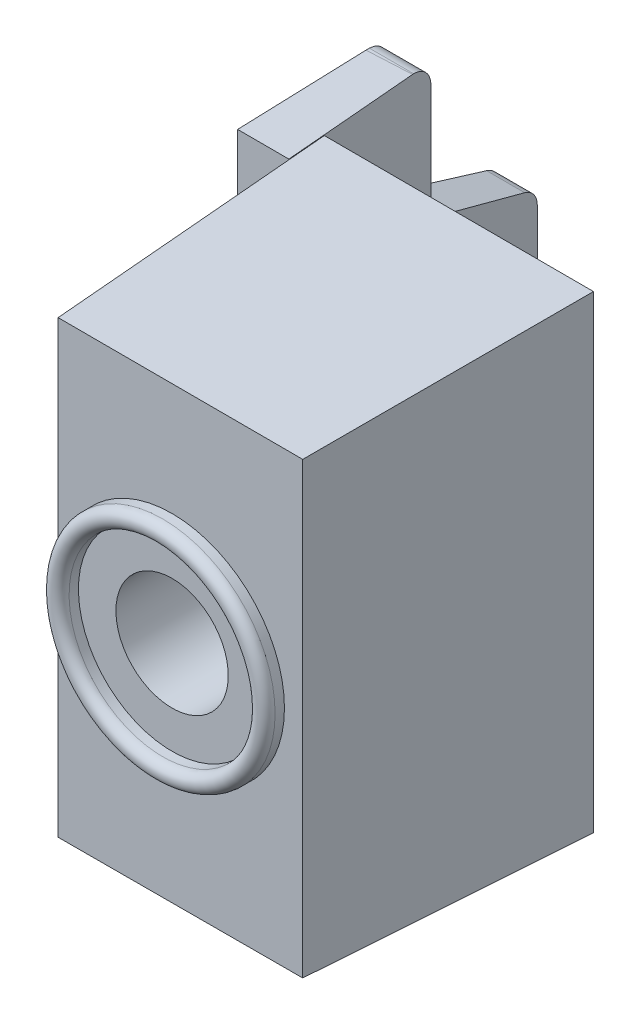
ISO-10303-21;
HEADER;
FILE_DESCRIPTION(('STEP AP214'),'2;1');
FILE_NAME('part.step','',(''),(''),'','','');
FILE_SCHEMA(('AUTOMOTIVE_DESIGN { 1 0 10303 214 1 1 1 1 }'));
ENDSEC;
DATA;
#1=APPLICATION_CONTEXT('core data for automotive mechanical design processes');
#2=APPLICATION_PROTOCOL_DEFINITION('international standard','automotive_design',2000,#1);
#3=PRODUCT_CONTEXT('',#1,'mechanical');
#4=PRODUCT('Part','Part','',(#3));
#5=PRODUCT_RELATED_PRODUCT_CATEGORY('part','',(#4));
#6=PRODUCT_DEFINITION_FORMATION('','',#4);
#7=PRODUCT_DEFINITION_CONTEXT('part definition',#1,'design');
#8=PRODUCT_DEFINITION('design','',#6,#7);
#9=PRODUCT_DEFINITION_SHAPE('','',#8);
#10=(LENGTH_UNIT() NAMED_UNIT(*) SI_UNIT(.MILLI.,.METRE.));
#11=(NAMED_UNIT(*) PLANE_ANGLE_UNIT() SI_UNIT($,.RADIAN.));
#12=(NAMED_UNIT(*) SI_UNIT($,.STERADIAN.) SOLID_ANGLE_UNIT());
#13=UNCERTAINTY_MEASURE_WITH_UNIT(LENGTH_MEASURE(1.E-05),#10,'distance_accuracy_value','');
#14=(GEOMETRIC_REPRESENTATION_CONTEXT(3) GLOBAL_UNCERTAINTY_ASSIGNED_CONTEXT((#13)) GLOBAL_UNIT_ASSIGNED_CONTEXT((#10,
#11,#12)) REPRESENTATION_CONTEXT('',''));
#15=CARTESIAN_POINT('',(0.,0.,0.));
#16=DIRECTION('',(0.,0.,1.));
#17=DIRECTION('',(1.,0.,0.));
#18=AXIS2_PLACEMENT_3D('',#15,#16,#17);
#19=CARTESIAN_POINT('',(7.5,12.75,0.));
#20=DIRECTION('',(0.,0.,1.));
#21=DIRECTION('',(0.,-1.,0.));
#22=AXIS2_PLACEMENT_3D('',#19,#20,#21);
#23=PLANE('',#22);
#24=CARTESIAN_POINT('',(0.,0.,0.));
#25=DIRECTION('',(0.,0.,-1.));
#26=DIRECTION('',(0.,1.,0.));
#27=AXIS2_PLACEMENT_3D('',#24,#25,#26);
#28=CIRCLE('',#27,3.);
#29=CARTESIAN_POINT('',(0.,3.,0.));
#30=VERTEX_POINT('',#29);
#31=EDGE_CURVE('E583',#30,#30,#28,.T.);
#32=ORIENTED_EDGE('',*,*,#31,.F.);
#33=EDGE_LOOP('',(#32));
#34=FACE_BOUND('',#33,.T.);
#35=CARTESIAN_POINT('',(0.,0.,0.));
#36=DIRECTION('',(0.,0.,-1.));
#37=DIRECTION('',(0.,1.,0.));
#38=AXIS2_PLACEMENT_3D('',#35,#36,#37);
#39=CIRCLE('',#38,4.98);
#40=CARTESIAN_POINT('',(0.,4.98,0.));
#41=VERTEX_POINT('',#40);
#42=EDGE_CURVE('E593',#41,#41,#39,.T.);
#43=ORIENTED_EDGE('',*,*,#42,.T.);
#44=EDGE_LOOP('',(#43));
#45=FACE_BOUND('',#44,.T.);
#46=ADVANCED_FACE('F14',(#34,#45),#23,.F.);
#47=DIRECTION('',(0.999998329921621,0.00182760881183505,0.));
#48=VECTOR('',#47,1.);
#49=CARTESIAN_POINT('',(7.5461719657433,-12.513551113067,0.));
#50=LINE('',#49,#48);
#51=CARTESIAN_POINT('',(-6.8711066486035,-12.5399003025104,0.));
#52=VERTEX_POINT('',#51);
#53=CARTESIAN_POINT('',(7.5,-12.5136354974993,0.));
#54=VERTEX_POINT('',#53);
#55=EDGE_CURVE('E220',#52,#54,#50,.T.);
#56=ORIENTED_EDGE('',*,*,#55,.F.);
#57=DIRECTION('',(0.,-1.,0.));
#58=VECTOR('',#57,1.);
#59=CARTESIAN_POINT('',(-6.8711066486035,12.75,0.));
#60=LINE('',#59,#58);
#61=CARTESIAN_POINT('',(-6.8711066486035,-5.76586572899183,0.));
#62=VERTEX_POINT('',#61);
#63=EDGE_CURVE('E407',#62,#52,#60,.T.);
#64=ORIENTED_EDGE('',*,*,#63,.F.);
#65=DIRECTION('',(0.,1.,0.));
#66=VECTOR('',#65,1.);
#67=CARTESIAN_POINT('',(-6.8711066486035,12.75,0.));
#68=LINE('',#67,#66);
#69=CARTESIAN_POINT('',(-6.8711066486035,5.76586572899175,0.));
#70=VERTEX_POINT('',#69);
#71=EDGE_CURVE('E350',#62,#70,#68,.T.);
#72=ORIENTED_EDGE('',*,*,#71,.T.);
#73=CARTESIAN_POINT('',(-6.8711066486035,12.5399003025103,0.));
#74=VERTEX_POINT('',#73);
#75=EDGE_CURVE('E408',#74,#70,#60,.T.);
#76=ORIENTED_EDGE('',*,*,#75,.F.);
#77=DIRECTION('',(-0.999998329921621,0.00182760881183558,0.));
#78=VECTOR('',#77,1.);
#79=CARTESIAN_POINT('',(7.49956801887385,12.5136362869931,0.));
#80=LINE('',#79,#78);
#81=CARTESIAN_POINT('',(7.5,12.5136354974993,0.));
#82=VERTEX_POINT('',#81);
#83=EDGE_CURVE('E419',#82,#74,#80,.T.);
#84=ORIENTED_EDGE('',*,*,#83,.F.);
#85=DIRECTION('',(0.,-1.,0.));
#86=VECTOR('',#85,1.);
#87=CARTESIAN_POINT('',(7.5,12.75,0.));
#88=LINE('',#87,#86);
#89=EDGE_CURVE('E232',#82,#54,#88,.T.);
#90=ORIENTED_EDGE('',*,*,#89,.T.);
#91=EDGE_LOOP('',(#56,#64,#72,#76,#84,#90));
#92=FACE_BOUND('',#91,.T.);
#93=CARTESIAN_POINT('',(0.,0.,0.));
#94=DIRECTION('',(0.,0.,-1.));
#95=DIRECTION('',(0.,1.,0.));
#96=AXIS2_PLACEMENT_3D('',#93,#94,#95);
#97=CIRCLE('',#96,5.73);
#98=CARTESIAN_POINT('',(0.,5.73,0.));
#99=VERTEX_POINT('',#98);
#100=EDGE_CURVE('E602',#99,#99,#97,.T.);
#101=ORIENTED_EDGE('',*,*,#100,.F.);
#102=EDGE_LOOP('',(#101));
#103=FACE_BOUND('',#102,.T.);
#104=ADVANCED_FACE('F414',(#92,#103),#23,.F.);
#105=CARTESIAN_POINT('',(-6.0849899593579,12.75,15.));
#106=DIRECTION('',(0.,0.,-1.));
#107=DIRECTION('',(0.,1.,0.));
#108=AXIS2_PLACEMENT_3D('',#105,#106,#107);
#109=PLANE('',#108);
#110=CARTESIAN_POINT('',(0.,0.,15.));
#111=DIRECTION('',(0.,0.,-1.));
#112=DIRECTION('',(0.,1.,0.));
#113=AXIS2_PLACEMENT_3D('',#110,#111,#112);
#114=CIRCLE('',#113,6.);
#115=CARTESIAN_POINT('',(0.,6.,15.));
#116=VERTEX_POINT('',#115);
#117=EDGE_CURVE('E246',#116,#116,#114,.F.);
#118=ORIENTED_EDGE('',*,*,#117,.F.);
#119=EDGE_LOOP('',(#118));
#120=FACE_BOUND('',#119,.T.);
#121=DIRECTION('',(-0.999998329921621,-0.00182760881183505,0.));
#122=VECTOR('',#121,1.);
#123=CARTESIAN_POINT('',(-6.03972862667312,-12.0152871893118,15.));
#124=LINE('',#123,#122);
#125=CARTESIAN_POINT('',(6.976188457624,-11.9914991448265,15.));
#126=VERTEX_POINT('',#125);
#127=CARTESIAN_POINT('',(-6.08498995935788,-12.0153699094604,15.));
#128=VERTEX_POINT('',#127);
#129=EDGE_CURVE('E425',#126,#128,#124,.T.);
#130=ORIENTED_EDGE('',*,*,#129,.F.);
#131=DIRECTION('',(0.,-1.,0.));
#132=VECTOR('',#131,1.);
#133=CARTESIAN_POINT('',(6.976188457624,12.75,15.));
#134=LINE('',#133,#132);
#135=CARTESIAN_POINT('',(6.976188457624,11.9914991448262,15.));
#136=VERTEX_POINT('',#135);
#137=EDGE_CURVE('E219',#136,#126,#134,.T.);
#138=ORIENTED_EDGE('',*,*,#137,.F.);
#139=DIRECTION('',(0.999998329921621,-0.00182760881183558,0.));
#140=VECTOR('',#139,1.);
#141=CARTESIAN_POINT('',(-6.08633257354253,12.0153723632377,15.));
#142=LINE('',#141,#140);
#143=CARTESIAN_POINT('',(-6.08498995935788,12.0153699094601,15.));
#144=VERTEX_POINT('',#143);
#145=EDGE_CURVE('E202',#144,#136,#142,.T.);
#146=ORIENTED_EDGE('',*,*,#145,.F.);
#147=DIRECTION('',(0.,-1.,0.));
#148=VECTOR('',#147,1.);
#149=CARTESIAN_POINT('',(-6.0849899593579,12.75,15.));
#150=LINE('',#149,#148);
#151=EDGE_CURVE('E217',#144,#128,#150,.T.);
#152=ORIENTED_EDGE('',*,*,#151,.T.);
#153=EDGE_LOOP('',(#130,#138,#146,#152));
#154=FACE_BOUND('',#153,.T.);
#155=ADVANCED_FACE('F216',(#120,#154),#109,.F.);
#156=CARTESIAN_POINT('',(-6.7662910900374,12.75,2.));
#157=DIRECTION('',(0.998629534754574,0.,-0.0523359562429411));
#158=DIRECTION('',(-0.0523359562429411,0.,-0.998629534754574));
#159=AXIS2_PLACEMENT_3D('',#156,#157,#158);
#160=PLANE('',#159);
#161=DIRECTION('',(0.0523040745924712,0.034899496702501,0.998021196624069));
#162=VECTOR('',#161,1.);
#163=CARTESIAN_POINT('',(-7.18598426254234,-12.75,-6.00822279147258));
#164=LINE('',#163,#162);
#165=CARTESIAN_POINT('',(-6.76629109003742,-12.4699629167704,2.));
#166=VERTEX_POINT('',#165);
#167=EDGE_CURVE('E226',#166,#128,#164,.T.);
#168=ORIENTED_EDGE('',*,*,#167,.T.);
#169=ORIENTED_EDGE('',*,*,#151,.F.);
#170=DIRECTION('',(-0.0523040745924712,0.0348994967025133,-0.998021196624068));
#171=VECTOR('',#170,1.);
#172=CARTESIAN_POINT('',(-5.87758535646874,11.876980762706,18.9575155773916));
#173=LINE('',#172,#171);
#174=CARTESIAN_POINT('',(-6.76629109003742,12.4699629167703,2.));
#175=VERTEX_POINT('',#174);
#176=EDGE_CURVE('E199',#144,#175,#173,.T.);
#177=ORIENTED_EDGE('',*,*,#176,.T.);
#178=DIRECTION('',(0.,-1.,0.));
#179=VECTOR('',#178,1.);
#180=CARTESIAN_POINT('',(-6.7662910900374,12.75,2.));
#181=LINE('',#180,#179);
#182=CARTESIAN_POINT('',(-6.76629109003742,6.37816622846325,2.));
#183=VERTEX_POINT('',#182);
#184=EDGE_CURVE('E229',#175,#183,#181,.T.);
#185=ORIENTED_EDGE('',*,*,#184,.T.);
#186=DIRECTION('',(0.0500491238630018,0.292371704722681,0.95499417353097));
#187=VECTOR('',#186,1.);
#188=CARTESIAN_POINT('',(-7.14894985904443,4.142790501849,-5.30156427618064));
#189=LINE('',#188,#187);
#190=EDGE_CURVE('E312',#70,#183,#189,.T.);
#191=ORIENTED_EDGE('',*,*,#190,.F.);
#192=ORIENTED_EDGE('',*,*,#71,.F.);
#193=DIRECTION('',(-0.0500491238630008,0.292371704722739,-0.954994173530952));
#194=VECTOR('',#193,1.);
#195=CARTESIAN_POINT('',(-6.68355908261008,-6.8614613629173,3.5786207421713));
#196=LINE('',#195,#194);
#197=CARTESIAN_POINT('',(-6.7662910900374,-6.37816622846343,2.));
#198=VERTEX_POINT('',#197);
#199=EDGE_CURVE('E327',#198,#62,#196,.T.);
#200=ORIENTED_EDGE('',*,*,#199,.F.);
#201=EDGE_CURVE('E227',#198,#166,#181,.T.);
#202=ORIENTED_EDGE('',*,*,#201,.T.);
#203=EDGE_LOOP('',(#168,#169,#177,#185,#191,#192,#200,#202));
#204=FACE_BOUND('',#203,.T.);
#205=ADVANCED_FACE('F224',(#204),#160,.F.);
#206=CARTESIAN_POINT('',(6.976188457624,12.75,15.));
#207=DIRECTION('',(-0.999390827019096,0.,-0.0348994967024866));
#208=DIRECTION('',(-0.0348994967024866,0.,0.999390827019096));
#209=AXIS2_PLACEMENT_3D('',#206,#207,#208);
#210=PLANE('',#209);
#211=DIRECTION('',(-0.0348783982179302,0.0347668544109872,0.998786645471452));
#212=VECTOR('',#211,1.);
#213=CARTESIAN_POINT('',(6.9461866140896,-11.9615932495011,15.8591403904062));
#214=LINE('',#213,#212);
#215=EDGE_CURVE('E423',#54,#126,#214,.T.);
#216=ORIENTED_EDGE('',*,*,#215,.F.);
#217=ORIENTED_EDGE('',*,*,#89,.F.);
#218=DIRECTION('',(0.0348783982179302,0.0347668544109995,-0.998786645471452));
#219=VECTOR('',#218,1.);
#220=CARTESIAN_POINT('',(6.97710822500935,11.9924159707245,14.9736613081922));
#221=LINE('',#220,#219);
#222=EDGE_CURVE('E221',#136,#82,#221,.T.);
#223=ORIENTED_EDGE('',*,*,#222,.F.);
#224=ORIENTED_EDGE('',*,*,#137,.T.);
#225=EDGE_LOOP('',(#216,#217,#223,#224));
#226=FACE_BOUND('',#225,.T.);
#227=ADVANCED_FACE('F422',(#226),#210,.F.);
#228=CARTESIAN_POINT('',(-9.5,-12.75,-12.));
#229=DIRECTION('',(0.,1.,0.));
#230=DIRECTION('',(0.,0.,1.));
#231=AXIS2_PLACEMENT_3D('',#228,#229,#230);
#232=PLANE('',#231);
#233=DIRECTION('',(0.998629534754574,0.,-0.0523359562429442));
#234=VECTOR('',#233,1.);
#235=CARTESIAN_POINT('',(-12.1249694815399,-12.75,-4.7130618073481));
#236=LINE('',#235,#234);
#237=CARTESIAN_POINT('',(-9.5,-12.75,-4.85063062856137));
#238=VERTEX_POINT('',#237);
#239=CARTESIAN_POINT('',(-7.13182180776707,-12.75,-4.97474158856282));
#240=VERTEX_POINT('',#239);
#241=EDGE_CURVE('E340',#238,#240,#236,.T.);
#242=ORIENTED_EDGE('',*,*,#241,.F.);
#243=DIRECTION('',(0.,0.,1.));
#244=VECTOR('',#243,1.);
#245=CARTESIAN_POINT('',(-9.5,-12.75,-12.));
#246=LINE('',#245,#244);
#247=CARTESIAN_POINT('',(-9.5,-12.75,-5.03489949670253));
#248=VERTEX_POINT('',#247);
#249=EDGE_CURVE('E392',#248,#238,#246,.T.);
#250=ORIENTED_EDGE('',*,*,#249,.F.);
#251=DIRECTION('',(-1.,0.,0.));
#252=VECTOR('',#251,1.);
#253=CARTESIAN_POINT('',(-4.5,-12.75,-5.03489949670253));
#254=LINE('',#253,#252);
#255=CARTESIAN_POINT('',(-7.13497455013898,-12.75,-5.03489949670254));
#256=VERTEX_POINT('',#255);
#257=EDGE_CURVE('E305',#256,#248,#254,.T.);
#258=ORIENTED_EDGE('',*,*,#257,.F.);
#259=DIRECTION('',(-0.0523359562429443,0.,-0.998629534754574));
#260=VECTOR('',#259,1.);
#261=CARTESIAN_POINT('',(-6.8711066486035,-12.75,0.));
#262=LINE('',#261,#260);
#263=EDGE_CURVE('E395',#240,#256,#262,.T.);
#264=ORIENTED_EDGE('',*,*,#263,.F.);
#265=EDGE_LOOP('',(#242,#250,#258,#264));
#266=FACE_BOUND('',#265,.T.);
#267=ADVANCED_FACE('F505',(#266),#232,.F.);
#268=CARTESIAN_POINT('',(-7.5,12.75,-12.));
#269=DIRECTION('',(0.,0.,1.));
#270=DIRECTION('',(0.,-1.,0.));
#271=AXIS2_PLACEMENT_3D('',#268,#269,#270);
#272=PLANE('',#271);
#273=DIRECTION('',(-1.,0.,0.));
#274=VECTOR('',#273,1.);
#275=CARTESIAN_POINT('',(-4.5,3.000038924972,-12.));
#276=LINE('',#275,#274);
#277=CARTESIAN_POINT('',(-7.5,3.000038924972,-12.));
#278=VERTEX_POINT('',#277);
#279=CARTESIAN_POINT('',(-9.5,3.000038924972,-12.));
#280=VERTEX_POINT('',#279);
#281=EDGE_CURVE('E293',#278,#280,#276,.T.);
#282=ORIENTED_EDGE('',*,*,#281,.F.);
#283=DIRECTION('',(0.,-1.,0.));
#284=VECTOR('',#283,1.);
#285=CARTESIAN_POINT('',(-7.5,12.75,-12.));
#286=LINE('',#285,#284);
#287=CARTESIAN_POINT('',(-7.5,-3.0000389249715,-12.));
#288=VERTEX_POINT('',#287);
#289=EDGE_CURVE('E404',#278,#288,#286,.T.);
#290=ORIENTED_EDGE('',*,*,#289,.T.);
#291=DIRECTION('',(-1.,0.,0.));
#292=VECTOR('',#291,1.);
#293=CARTESIAN_POINT('',(-4.5,-3.0000389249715,-12.));
#294=LINE('',#293,#292);
#295=CARTESIAN_POINT('',(-9.5,-3.0000389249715,-12.));
#296=VERTEX_POINT('',#295);
#297=EDGE_CURVE('E472',#288,#296,#294,.T.);
#298=ORIENTED_EDGE('',*,*,#297,.T.);
#299=DIRECTION('',(0.,-1.,0.));
#300=VECTOR('',#299,1.);
#301=CARTESIAN_POINT('',(-9.5,12.75,-12.));
#302=LINE('',#301,#300);
#303=EDGE_CURVE('E240',#280,#296,#302,.T.);
#304=ORIENTED_EDGE('',*,*,#303,.F.);
#305=EDGE_LOOP('',(#282,#290,#298,#304));
#306=FACE_BOUND('',#305,.T.);
#307=ADVANCED_FACE('F16',(#306),#272,.F.);
#308=CARTESIAN_POINT('',(-9.5,12.75,-12.));
#309=DIRECTION('',(1.,0.,0.));
#310=DIRECTION('',(0.,1.,0.));
#311=AXIS2_PLACEMENT_3D('',#308,#309,#310);
#312=PLANE('',#311);
#313=CARTESIAN_POINT('',(-9.5,11.7506091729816,-5.00000000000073));
#314=DIRECTION('',(-1.,0.,0.));
#315=DIRECTION('',(0.,0.,1.));
#316=AXIS2_PLACEMENT_3D('',#313,#314,#315);
#317=CIRCLE('',#316,0.999999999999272);
#318=CARTESIAN_POINT('',(-9.5,12.75,-5.03489949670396));
#319=VERTEX_POINT('',#318);
#320=CARTESIAN_POINT('',(-9.5,11.750609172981,-6.));
#321=VERTEX_POINT('',#320);
#322=EDGE_CURVE('E427',#319,#321,#317,.T.);
#323=ORIENTED_EDGE('',*,*,#322,.T.);
#324=DIRECTION('',(0.,-1.,0.));
#325=VECTOR('',#324,1.);
#326=CARTESIAN_POINT('',(-9.5,11.750609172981,-6.));
#327=LINE('',#326,#325);
#328=CARTESIAN_POINT('',(-9.5,6.31434516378,-6.));
#329=VERTEX_POINT('',#328);
#330=EDGE_CURVE('E434',#321,#329,#327,.T.);
#331=ORIENTED_EDGE('',*,*,#330,.T.);
#332=CARTESIAN_POINT('',(-9.5,6.3143451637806,-7.00000000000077));
#333=DIRECTION('',(1.,0.,0.));
#334=DIRECTION('',(0.,0.,1.));
#335=AXIS2_PLACEMENT_3D('',#332,#333,#334);
#336=CIRCLE('',#335,1.00000000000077);
#337=CARTESIAN_POINT('',(-9.5,5.358040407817,-6.7076282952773));
#338=VERTEX_POINT('',#337);
#339=EDGE_CURVE('E278',#329,#338,#336,.T.);
#340=ORIENTED_EDGE('',*,*,#339,.T.);
#341=DIRECTION('',(0.,-0.292371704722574,-0.956304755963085));
#342=VECTOR('',#341,1.);
#343=CARTESIAN_POINT('',(-9.5,5.358040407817,-6.7076282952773));
#344=LINE('',#343,#342);
#345=CARTESIAN_POINT('',(-9.5,3.956343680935,-11.2923717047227));
#346=VERTEX_POINT('',#345);
#347=EDGE_CURVE('E291',#338,#346,#344,.T.);
#348=ORIENTED_EDGE('',*,*,#347,.T.);
#349=CARTESIAN_POINT('',(-9.5,3.0000389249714,-10.9999999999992));
#350=DIRECTION('',(-1.,0.,0.));
#351=DIRECTION('',(0.,0.,1.));
#352=AXIS2_PLACEMENT_3D('',#349,#350,#351);
#353=CIRCLE('',#352,1.00000000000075);
#354=EDGE_CURVE('E441',#346,#280,#353,.T.);
#355=ORIENTED_EDGE('',*,*,#354,.T.);
#356=ORIENTED_EDGE('',*,*,#303,.T.);
#357=CARTESIAN_POINT('',(-9.5,-3.00003892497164,-11.0000000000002));
#358=DIRECTION('',(-1.,0.,0.));
#359=DIRECTION('',(0.,0.,1.));
#360=AXIS2_PLACEMENT_3D('',#357,#358,#359);
#361=CIRCLE('',#360,0.999999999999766);
#362=CARTESIAN_POINT('',(-9.5,-3.9563436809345,-11.2923717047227));
#363=VERTEX_POINT('',#362);
#364=EDGE_CURVE('E445',#296,#363,#361,.T.);
#365=ORIENTED_EDGE('',*,*,#364,.T.);
#366=DIRECTION('',(0.,-0.292371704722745,0.956304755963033));
#367=VECTOR('',#366,1.);
#368=CARTESIAN_POINT('',(-9.5,-3.9563436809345,-11.2923717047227));
#369=LINE('',#368,#367);
#370=CARTESIAN_POINT('',(-9.5,-5.3580404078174,-6.7076282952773));
#371=VERTEX_POINT('',#370);
#372=EDGE_CURVE('E449',#363,#371,#369,.T.);
#373=ORIENTED_EDGE('',*,*,#372,.T.);
#374=CARTESIAN_POINT('',(-9.5,-6.31434516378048,-7.));
#375=DIRECTION('',(1.,0.,0.));
#376=DIRECTION('',(0.,0.,-1.));
#377=AXIS2_PLACEMENT_3D('',#374,#375,#376);
#378=CIRCLE('',#377,1.00000000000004);
#379=CARTESIAN_POINT('',(-9.5,-6.31434516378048,-6.));
#380=VERTEX_POINT('',#379);
#381=EDGE_CURVE('E453',#371,#380,#378,.T.);
#382=ORIENTED_EDGE('',*,*,#381,.T.);
#383=DIRECTION('',(0.,-1.,0.));
#384=VECTOR('',#383,1.);
#385=CARTESIAN_POINT('',(-9.5,-6.3143451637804,-6.));
#386=LINE('',#385,#384);
#387=CARTESIAN_POINT('',(-9.5,-11.7506091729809,-6.));
#388=VERTEX_POINT('',#387);
#389=EDGE_CURVE('E457',#380,#388,#386,.T.);
#390=ORIENTED_EDGE('',*,*,#389,.T.);
#391=CARTESIAN_POINT('',(-9.5,-11.7506091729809,-5.));
#392=DIRECTION('',(-1.,0.,0.));
#393=DIRECTION('',(0.,0.,1.));
#394=AXIS2_PLACEMENT_3D('',#391,#392,#393);
#395=CIRCLE('',#394,0.999999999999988);
#396=EDGE_CURVE('E461',#388,#248,#395,.T.);
#397=ORIENTED_EDGE('',*,*,#396,.T.);
#398=ORIENTED_EDGE('',*,*,#249,.T.);
#399=DIRECTION('',(0.,0.0348517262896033,0.999392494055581));
#400=VECTOR('',#399,1.);
#401=CARTESIAN_POINT('',(-9.5,-12.968043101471,-11.10313695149));
#402=LINE('',#401,#400);
#403=CARTESIAN_POINT('',(-9.5,-12.5110985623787,2.));
#404=VERTEX_POINT('',#403);
#405=EDGE_CURVE('E356',#238,#404,#402,.T.);
#406=ORIENTED_EDGE('',*,*,#405,.T.);
#407=DIRECTION('',(0.,-1.,0.));
#408=VECTOR('',#407,1.);
#409=CARTESIAN_POINT('',(-9.5,12.75,2.));
#410=LINE('',#409,#408);
#411=CARTESIAN_POINT('',(-9.5,-6.33442495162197,2.));
#412=VERTEX_POINT('',#411);
#413=EDGE_CURVE('E236',#412,#404,#410,.T.);
#414=ORIENTED_EDGE('',*,*,#413,.F.);
#415=DIRECTION('',(0.,0.292005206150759,-0.956416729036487));
#416=VECTOR('',#415,1.);
#417=CARTESIAN_POINT('',(-9.5,-0.797251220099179,-16.1361341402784));
#418=LINE('',#417,#416);
#419=CARTESIAN_POINT('',(-9.5,-4.1427905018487,-5.17835095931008));
#420=VERTEX_POINT('',#419);
#421=EDGE_CURVE('E371',#412,#420,#418,.T.);
#422=ORIENTED_EDGE('',*,*,#421,.T.);
#423=CARTESIAN_POINT('',(-9.5,-3.18648574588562,-4.88557801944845));
#424=DIRECTION('',(1.,0.,0.));
#425=DIRECTION('',(0.,0.,-1.));
#426=AXIS2_PLACEMENT_3D('',#423,#424,#425);
#427=ELLIPSE('',#426,1.00137234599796,1.00000000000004);
#428=CARTESIAN_POINT('',(-9.5,-3.1864857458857,-5.88695036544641));
#429=VERTEX_POINT('',#428);
#430=EDGE_CURVE('E365',#420,#429,#427,.T.);
#431=ORIENTED_EDGE('',*,*,#430,.T.);
#432=DIRECTION('',(0.,1.,0.));
#433=VECTOR('',#432,1.);
#434=CARTESIAN_POINT('',(-9.5,12.75,-5.88695036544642));
#435=LINE('',#434,#433);
#436=CARTESIAN_POINT('',(-9.5,3.186485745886,-5.88695036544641));
#437=VERTEX_POINT('',#436);
#438=EDGE_CURVE('E383',#429,#437,#435,.T.);
#439=ORIENTED_EDGE('',*,*,#438,.T.);
#440=CARTESIAN_POINT('',(-9.5,3.1864857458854,-4.88557801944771));
#441=DIRECTION('',(1.,0.,0.));
#442=DIRECTION('',(0.,0.,-1.));
#443=AXIS2_PLACEMENT_3D('',#440,#441,#442);
#444=ELLIPSE('',#443,1.0013723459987,1.00000000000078);
#445=CARTESIAN_POINT('',(-9.5,4.142790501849,-5.17835095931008));
#446=VERTEX_POINT('',#445);
#447=EDGE_CURVE('E380',#437,#446,#444,.T.);
#448=ORIENTED_EDGE('',*,*,#447,.T.);
#449=DIRECTION('',(0.,0.2920052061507,0.956416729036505));
#450=VECTOR('',#449,1.);
#451=CARTESIAN_POINT('',(-9.5,2.97156075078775,-9.01452820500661));
#452=LINE('',#451,#450);
#453=CARTESIAN_POINT('',(-9.5,6.3344249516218,2.));
#454=VERTEX_POINT('',#453);
#455=EDGE_CURVE('E377',#446,#454,#452,.T.);
#456=ORIENTED_EDGE('',*,*,#455,.T.);
#457=CARTESIAN_POINT('',(-9.5,12.5110985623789,2.));
#458=VERTEX_POINT('',#457);
#459=EDGE_CURVE('E239',#458,#454,#410,.T.);
#460=ORIENTED_EDGE('',*,*,#459,.F.);
#461=DIRECTION('',(0.,0.0348517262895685,-0.999392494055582));
#462=VECTOR('',#461,1.);
#463=CARTESIAN_POINT('',(-9.5,12.9990164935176,-11.9913160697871));
#464=LINE('',#463,#462);
#465=CARTESIAN_POINT('',(-9.5,12.75,-4.85063062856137));
#466=VERTEX_POINT('',#465);
#467=EDGE_CURVE('E362',#458,#466,#464,.T.);
#468=ORIENTED_EDGE('',*,*,#467,.T.);
#469=DIRECTION('',(0.,0.,1.));
#470=VECTOR('',#469,1.);
#471=CARTESIAN_POINT('',(-9.5,12.75,-12.));
#472=LINE('',#471,#470);
#473=EDGE_CURVE('E399',#319,#466,#472,.T.);
#474=ORIENTED_EDGE('',*,*,#473,.F.);
#475=EDGE_LOOP('',(#323,#331,#340,#348,#355,#356,#365,#373,#382,#390,#397,#398,#406,#414,#422,
#431,#439,#448,#456,#460,#468,#474));
#476=FACE_BOUND('',#475,.T.);
#477=ADVANCED_FACE('F479',(#476),#312,.F.);
#478=CARTESIAN_POINT('',(-6.8711066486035,12.75,0.));
#479=DIRECTION('',(-0.998629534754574,0.,0.0523359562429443));
#480=DIRECTION('',(0.0523359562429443,0.,0.998629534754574));
#481=AXIS2_PLACEMENT_3D('',#478,#479,#480);
#482=PLANE('',#481);
#483=DIRECTION('',(-0.0523359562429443,0.,-0.998629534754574));
#484=VECTOR('',#483,1.);
#485=CARTESIAN_POINT('',(-6.8711066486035,12.75,0.));
#486=LINE('',#485,#484);
#487=CARTESIAN_POINT('',(-7.13182180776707,12.75,-4.97474158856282));
#488=VERTEX_POINT('',#487);
#489=CARTESIAN_POINT('',(-7.13497455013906,12.75,-5.03489949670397));
#490=VERTEX_POINT('',#489);
#491=EDGE_CURVE('E401',#488,#490,#486,.T.);
#492=ORIENTED_EDGE('',*,*,#491,.F.);
#493=DIRECTION('',(-0.0523040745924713,0.0348994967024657,-0.99802119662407));
#494=VECTOR('',#493,1.);
#495=CARTESIAN_POINT('',(-6.68355908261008,12.450900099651,3.5786207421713));
#496=LINE('',#495,#494);
#497=CARTESIAN_POINT('',(-6.76629109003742,12.5061024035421,2.));
#498=VERTEX_POINT('',#497);
#499=EDGE_CURVE('E317',#498,#488,#496,.T.);
#500=ORIENTED_EDGE('',*,*,#499,.F.);
#501=EDGE_CURVE('E231',#498,#175,#181,.T.);
#502=ORIENTED_EDGE('',*,*,#501,.T.);
#503=EDGE_CURVE('E205',#175,#74,#173,.T.);
#504=ORIENTED_EDGE('',*,*,#503,.T.);
#505=ORIENTED_EDGE('',*,*,#75,.T.);
#506=CARTESIAN_POINT('',(-7.14894985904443,4.142790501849,-5.30156427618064));
#507=VERTEX_POINT('',#506);
#508=EDGE_CURVE('E313',#507,#70,#189,.T.);
#509=ORIENTED_EDGE('',*,*,#508,.F.);
#510=CARTESIAN_POINT('',(-7.13364830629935,3.1864857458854,-5.00959325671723));
#511=DIRECTION('',(0.998629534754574,0.,-0.0523359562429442));
#512=DIRECTION('',(0.0523359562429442,0.,0.998629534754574));
#513=AXIS2_PLACEMENT_3D('',#510,#511,#512);
#514=CIRCLE('',#513,1.00000000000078);
#515=CARTESIAN_POINT('',(-7.18598426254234,3.186485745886,-6.00822279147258));
#516=VERTEX_POINT('',#515);
#517=EDGE_CURVE('E308',#516,#507,#514,.T.);
#518=ORIENTED_EDGE('',*,*,#517,.F.);
#519=DIRECTION('',(0.,1.,0.));
#520=VECTOR('',#519,1.);
#521=CARTESIAN_POINT('',(-7.18598426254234,-3.1864857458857,-6.00822279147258));
#522=LINE('',#521,#520);
#523=CARTESIAN_POINT('',(-7.18598426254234,-3.1864857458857,-6.00822279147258));
#524=VERTEX_POINT('',#523);
#525=EDGE_CURVE('E307',#524,#516,#522,.T.);
#526=ORIENTED_EDGE('',*,*,#525,.F.);
#527=CARTESIAN_POINT('',(-7.13364830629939,-3.18648574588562,-5.00959325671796));
#528=DIRECTION('',(0.998629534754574,0.,-0.0523359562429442));
#529=DIRECTION('',(0.0523359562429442,0.,0.998629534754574));
#530=AXIS2_PLACEMENT_3D('',#527,#528,#529);
#531=CIRCLE('',#530,1.00000000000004);
#532=CARTESIAN_POINT('',(-7.14894985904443,-4.1427905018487,-5.30156427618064));
#533=VERTEX_POINT('',#532);
#534=EDGE_CURVE('E328',#533,#524,#531,.T.);
#535=ORIENTED_EDGE('',*,*,#534,.F.);
#536=EDGE_CURVE('E324',#62,#533,#196,.T.);
#537=ORIENTED_EDGE('',*,*,#536,.F.);
#538=ORIENTED_EDGE('',*,*,#63,.T.);
#539=EDGE_CURVE('E578',#52,#166,#164,.T.);
#540=ORIENTED_EDGE('',*,*,#539,.T.);
#541=DIRECTION('',(0.,-1.,0.));
#542=VECTOR('',#541,1.);
#543=CARTESIAN_POINT('',(-6.76629109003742,12.75,2.));
#544=LINE('',#543,#542);
#545=CARTESIAN_POINT('',(-6.76629109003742,-12.5061024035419,2.));
#546=VERTEX_POINT('',#545);
#547=EDGE_CURVE('E210',#166,#546,#544,.T.);
#548=ORIENTED_EDGE('',*,*,#547,.T.);
#549=DIRECTION('',(0.0523040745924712,0.0348994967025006,0.998021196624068));
#550=VECTOR('',#549,1.);
#551=CARTESIAN_POINT('',(-7.13182180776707,-12.75,-4.97474158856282));
#552=LINE('',#551,#550);
#553=EDGE_CURVE('E320',#240,#546,#552,.T.);
#554=ORIENTED_EDGE('',*,*,#553,.F.);
#555=ORIENTED_EDGE('',*,*,#263,.T.);
#556=CARTESIAN_POINT('',(-7.13314554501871,-11.7506091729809,-5.));
#557=DIRECTION('',(-0.998629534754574,0.,0.0523359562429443));
#558=DIRECTION('',(-0.0523359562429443,0.,-0.998629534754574));
#559=AXIS2_PLACEMENT_3D('',#556,#557,#558);
#560=ELLIPSE('',#559,1.00137234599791,0.999999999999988);
#561=CARTESIAN_POINT('',(-7.18555332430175,-11.7506091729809,-6.));
#562=VERTEX_POINT('',#561);
#563=EDGE_CURVE('E303',#562,#256,#560,.T.);
#564=ORIENTED_EDGE('',*,*,#563,.F.);
#565=DIRECTION('',(0.,-1.,0.));
#566=VECTOR('',#565,1.);
#567=CARTESIAN_POINT('',(-7.18555332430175,12.75,-6.));
#568=LINE('',#567,#566);
#569=CARTESIAN_POINT('',(-7.18555332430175,-6.31434516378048,-6.));
#570=VERTEX_POINT('',#569);
#571=EDGE_CURVE('E249',#570,#562,#568,.T.);
#572=ORIENTED_EDGE('',*,*,#571,.F.);
#573=CARTESIAN_POINT('',(-7.2379611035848,-6.31434516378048,-7.));
#574=DIRECTION('',(-0.998629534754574,0.,0.0523359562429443));
#575=DIRECTION('',(-0.0523359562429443,0.,-0.998629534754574));
#576=AXIS2_PLACEMENT_3D('',#573,#574,#575);
#577=ELLIPSE('',#576,1.00137234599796,1.00000000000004);
#578=CARTESIAN_POINT('',(-7.22263855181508,-5.3580404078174,-6.7076282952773));
#579=VERTEX_POINT('',#578);
#580=EDGE_CURVE('E251',#579,#570,#577,.F.);
#581=ORIENTED_EDGE('',*,*,#580,.F.);
#582=DIRECTION('',(0.0500549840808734,-0.292005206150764,0.955105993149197));
#583=VECTOR('',#582,1.);
#584=CARTESIAN_POINT('',(-7.16575357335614,-5.68988967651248,-5.62219824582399));
#585=LINE('',#584,#583);
#586=CARTESIAN_POINT('',(-7.46291477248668,-3.9563436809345,-11.2923717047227));
#587=VERTEX_POINT('',#586);
#588=EDGE_CURVE('E253',#587,#579,#585,.T.);
#589=ORIENTED_EDGE('',*,*,#588,.F.);
#590=CARTESIAN_POINT('',(-7.44759222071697,-3.00003892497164,-11.0000000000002));
#591=DIRECTION('',(-0.998629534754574,0.,0.0523359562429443));
#592=DIRECTION('',(-0.0523359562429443,0.,-0.998629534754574));
#593=AXIS2_PLACEMENT_3D('',#590,#591,#592);
#594=ELLIPSE('',#593,1.00137234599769,0.999999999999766);
#595=EDGE_CURVE('E255',#288,#587,#594,.T.);
#596=ORIENTED_EDGE('',*,*,#595,.F.);
#597=ORIENTED_EDGE('',*,*,#289,.F.);
#598=CARTESIAN_POINT('',(-7.44759222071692,3.0000389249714,-10.9999999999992));
#599=DIRECTION('',(-0.998629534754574,0.,0.0523359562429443));
#600=DIRECTION('',(-0.0523359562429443,0.,-0.998629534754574));
#601=AXIS2_PLACEMENT_3D('',#598,#599,#600);
#602=ELLIPSE('',#601,1.00137234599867,1.00000000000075);
#603=CARTESIAN_POINT('',(-7.46291477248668,3.956343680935,-11.2923717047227));
#604=VERTEX_POINT('',#603);
#605=EDGE_CURVE('E257',#604,#278,#602,.T.);
#606=ORIENTED_EDGE('',*,*,#605,.F.);
#607=DIRECTION('',(-0.0500549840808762,-0.292005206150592,-0.955105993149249));
#608=VECTOR('',#607,1.);
#609=CARTESIAN_POINT('',(-6.79303751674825,7.8641992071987,1.4896477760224));
#610=LINE('',#609,#608);
#611=CARTESIAN_POINT('',(-7.22263855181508,5.358040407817,-6.7076282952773));
#612=VERTEX_POINT('',#611);
#613=EDGE_CURVE('E259',#612,#604,#610,.T.);
#614=ORIENTED_EDGE('',*,*,#613,.F.);
#615=CARTESIAN_POINT('',(-7.23796110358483,6.3143451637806,-7.00000000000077));
#616=DIRECTION('',(-0.998629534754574,0.,0.0523359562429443));
#617=DIRECTION('',(-0.0523359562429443,0.,-0.998629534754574));
#618=AXIS2_PLACEMENT_3D('',#615,#616,#617);
#619=ELLIPSE('',#618,1.0013723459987,1.00000000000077);
#620=CARTESIAN_POINT('',(-7.18555332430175,6.31434516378,-6.));
#621=VERTEX_POINT('',#620);
#622=EDGE_CURVE('E261',#621,#612,#619,.F.);
#623=ORIENTED_EDGE('',*,*,#622,.F.);
#624=DIRECTION('',(0.,-1.,0.));
#625=VECTOR('',#624,1.);
#626=CARTESIAN_POINT('',(-7.18555332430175,12.75,-6.));
#627=LINE('',#626,#625);
#628=CARTESIAN_POINT('',(-7.18555332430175,11.750609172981,-6.));
#629=VERTEX_POINT('',#628);
#630=EDGE_CURVE('E22',#629,#621,#627,.T.);
#631=ORIENTED_EDGE('',*,*,#630,.F.);
#632=CARTESIAN_POINT('',(-7.13314554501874,11.7506091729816,-5.00000000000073));
#633=DIRECTION('',(-0.998629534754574,0.,0.0523359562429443));
#634=DIRECTION('',(-0.0523359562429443,0.,-0.998629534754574));
#635=AXIS2_PLACEMENT_3D('',#632,#633,#634);
#636=ELLIPSE('',#635,1.00137234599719,0.999999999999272);
#637=EDGE_CURVE('E298',#490,#629,#636,.T.);
#638=ORIENTED_EDGE('',*,*,#637,.F.);
#639=EDGE_LOOP('',(#492,#500,#502,#504,#505,#509,#518,#526,#535,#537,#538,#540,#548,#554,#555,
#564,#572,#581,#589,#596,#597,#606,#614,#623,#631,#638));
#640=FACE_BOUND('',#639,.T.);
#641=ADVANCED_FACE('F284',(#640),#482,.F.);
#642=CARTESIAN_POINT('',(-9.5,12.75,2.));
#643=DIRECTION('',(0.,0.,-1.));
#644=DIRECTION('',(0.,1.,0.));
#645=AXIS2_PLACEMENT_3D('',#642,#643,#644);
#646=PLANE('',#645);
#647=ORIENTED_EDGE('',*,*,#459,.T.);
#648=DIRECTION('',(0.999872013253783,0.015998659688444,0.));
#649=VECTOR('',#648,1.);
#650=CARTESIAN_POINT('',(-9.39737253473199,6.3360670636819,2.));
#651=LINE('',#650,#649);
#652=EDGE_CURVE('E374',#454,#183,#651,.T.);
#653=ORIENTED_EDGE('',*,*,#652,.T.);
#654=ORIENTED_EDGE('',*,*,#184,.F.);
#655=ORIENTED_EDGE('',*,*,#501,.F.);
#656=DIRECTION('',(-0.999998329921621,0.00182760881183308,0.));
#657=VECTOR('',#656,1.);
#658=CARTESIAN_POINT('',(-9.50043661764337,12.5110993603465,2.));
#659=LINE('',#658,#657);
#660=EDGE_CURVE('E359',#498,#458,#659,.T.);
#661=ORIENTED_EDGE('',*,*,#660,.T.);
#662=EDGE_LOOP('',(#647,#653,#654,#655,#661));
#663=FACE_BOUND('',#662,.T.);
#664=ADVANCED_FACE('F538',(#663),#646,.F.);
#665=CARTESIAN_POINT('',(-9.5,12.75,-12.));
#666=DIRECTION('',(0.,1.,0.));
#667=DIRECTION('',(0.,0.,1.));
#668=AXIS2_PLACEMENT_3D('',#665,#666,#667);
#669=PLANE('',#668);
#670=DIRECTION('',(0.998629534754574,0.,-0.0523359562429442));
#671=VECTOR('',#670,1.);
#672=CARTESIAN_POINT('',(-12.1249694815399,12.75,-4.7130618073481));
#673=LINE('',#672,#671);
#674=EDGE_CURVE('E343',#466,#488,#673,.T.);
#675=ORIENTED_EDGE('',*,*,#674,.T.);
#676=ORIENTED_EDGE('',*,*,#491,.T.);
#677=DIRECTION('',(-1.,0.,0.));
#678=VECTOR('',#677,1.);
#679=CARTESIAN_POINT('',(-4.5,12.75,-5.03489949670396));
#680=LINE('',#679,#678);
#681=EDGE_CURVE('E300',#490,#319,#680,.T.);
#682=ORIENTED_EDGE('',*,*,#681,.T.);
#683=ORIENTED_EDGE('',*,*,#473,.T.);
#684=EDGE_LOOP('',(#675,#676,#682,#683));
#685=FACE_BOUND('',#684,.T.);
#686=ADVANCED_FACE('F546',(#685),#669,.T.);
#687=ORIENTED_EDGE('',*,*,#413,.T.);
#688=DIRECTION('',(0.999998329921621,0.00182760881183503,0.));
#689=VECTOR('',#688,1.);
#690=CARTESIAN_POINT('',(-9.45383267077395,-12.5110141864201,2.));
#691=LINE('',#690,#689);
#692=EDGE_CURVE('E353',#404,#546,#691,.T.);
#693=ORIENTED_EDGE('',*,*,#692,.T.);
#694=ORIENTED_EDGE('',*,*,#547,.F.);
#695=ORIENTED_EDGE('',*,*,#201,.F.);
#696=DIRECTION('',(-0.999872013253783,0.0159986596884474,0.));
#697=VECTOR('',#696,1.);
#698=CARTESIAN_POINT('',(-9.80528614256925,-6.32954015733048,2.));
#699=LINE('',#698,#697);
#700=EDGE_CURVE('E368',#198,#412,#699,.T.);
#701=ORIENTED_EDGE('',*,*,#700,.T.);
#702=EDGE_LOOP('',(#687,#693,#694,#695,#701));
#703=FACE_BOUND('',#702,.T.);
#704=ADVANCED_FACE('F513',(#703),#646,.F.);
#705=CARTESIAN_POINT('',(0.,0.,16.));
#706=DIRECTION('',(0.,0.,-1.));
#707=DIRECTION('',(0.,1.,0.));
#708=AXIS2_PLACEMENT_3D('',#705,#706,#707);
#709=CYLINDRICAL_SURFACE('',#708,6.);
#710=ORIENTED_EDGE('',*,*,#117,.T.);
#711=EDGE_LOOP('',(#710));
#712=FACE_BOUND('',#711,.T.);
#713=CARTESIAN_POINT('',(0.,0.,15.5));
#714=DIRECTION('',(0.,0.,-1.));
#715=DIRECTION('',(0.,1.,0.));
#716=AXIS2_PLACEMENT_3D('',#713,#714,#715);
#717=CIRCLE('',#716,6.);
#718=CARTESIAN_POINT('',(0.,6.,15.5));
#719=VERTEX_POINT('',#718);
#720=EDGE_CURVE('E386',#719,#719,#717,.T.);
#721=ORIENTED_EDGE('',*,*,#720,.T.);
#722=EDGE_LOOP('',(#721));
#723=FACE_BOUND('',#722,.T.);
#724=ADVANCED_FACE('F628',(#712,#723),#709,.T.);
#725=CARTESIAN_POINT('',(0.,0.,16.));
#726=DIRECTION('',(0.,0.,-1.));
#727=DIRECTION('',(0.,1.,0.));
#728=AXIS2_PLACEMENT_3D('',#725,#726,#727);
#729=CYLINDRICAL_SURFACE('',#728,5.);
#730=CARTESIAN_POINT('',(0.,0.,15.5));
#731=DIRECTION('',(0.,0.,-1.));
#732=DIRECTION('',(0.,1.,0.));
#733=AXIS2_PLACEMENT_3D('',#730,#731,#732);
#734=CIRCLE('',#733,5.);
#735=CARTESIAN_POINT('',(0.,5.,15.5));
#736=VERTEX_POINT('',#735);
#737=EDGE_CURVE('E389',#736,#736,#734,.T.);
#738=ORIENTED_EDGE('',*,*,#737,.F.);
#739=EDGE_LOOP('',(#738));
#740=FACE_BOUND('',#739,.T.);
#741=CARTESIAN_POINT('',(0.,0.,15.));
#742=DIRECTION('',(0.,0.,-1.));
#743=DIRECTION('',(0.,1.,0.));
#744=AXIS2_PLACEMENT_3D('',#741,#742,#743);
#745=CIRCLE('',#744,5.);
#746=CARTESIAN_POINT('',(0.,5.,15.));
#747=VERTEX_POINT('',#746);
#748=EDGE_CURVE('E243',#747,#747,#745,.T.);
#749=ORIENTED_EDGE('',*,*,#748,.T.);
#750=EDGE_LOOP('',(#749));
#751=FACE_BOUND('',#750,.T.);
#752=ADVANCED_FACE('F703',(#740,#751),#729,.F.);
#753=CARTESIAN_POINT('',(0.,0.,15.5));
#754=DIRECTION('',(0.,0.,-1.));
#755=DIRECTION('',(0.,1.,0.));
#756=AXIS2_PLACEMENT_3D('',#753,#754,#755);
#757=TOROIDAL_SURFACE('',#756,5.5,0.5);
#758=ORIENTED_EDGE('',*,*,#720,.F.);
#759=EDGE_LOOP('',(#758));
#760=FACE_BOUND('',#759,.T.);
#761=ORIENTED_EDGE('',*,*,#737,.T.);
#762=EDGE_LOOP('',(#761));
#763=FACE_BOUND('',#762,.T.);
#764=ADVANCED_FACE('F713',(#760,#763),#757,.T.);
#765=CARTESIAN_POINT('',(0.,0.,15.));
#766=DIRECTION('',(0.,0.,-1.));
#767=DIRECTION('',(0.,1.,0.));
#768=AXIS2_PLACEMENT_3D('',#765,#766,#767);
#769=CIRCLE('',#768,3.);
#770=CARTESIAN_POINT('',(0.,3.,15.));
#771=VERTEX_POINT('',#770);
#772=EDGE_CURVE('E9',#771,#771,#769,.T.);
#773=ORIENTED_EDGE('',*,*,#772,.T.);
#774=EDGE_LOOP('',(#773));
#775=FACE_BOUND('',#774,.T.);
#776=ORIENTED_EDGE('',*,*,#748,.F.);
#777=EDGE_LOOP('',(#776));
#778=FACE_BOUND('',#777,.T.);
#779=ADVANCED_FACE('F618',(#775,#778),#109,.F.);
#780=CARTESIAN_POINT('',(-12.1249694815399,-12.75,-4.7130618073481));
#781=DIRECTION('',(-0.00182649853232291,0.999390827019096,-0.0348516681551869));
#782=DIRECTION('',(0.,0.0348517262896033,0.999392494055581));
#783=AXIS2_PLACEMENT_3D('',#780,#781,#782);
#784=PLANE('',#783);
#785=ORIENTED_EDGE('',*,*,#241,.T.);
#786=ORIENTED_EDGE('',*,*,#553,.T.);
#787=ORIENTED_EDGE('',*,*,#692,.F.);
#788=ORIENTED_EDGE('',*,*,#405,.F.);
#789=EDGE_LOOP('',(#785,#786,#787,#788));
#790=FACE_BOUND('',#789,.T.);
#791=ADVANCED_FACE('F510',(#790),#784,.F.);
#792=CARTESIAN_POINT('',(-11.6767067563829,12.450900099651,3.840300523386));
#793=DIRECTION('',(-0.00182649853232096,-0.999390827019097,-0.0348516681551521));
#794=DIRECTION('',(0.,0.0348517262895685,-0.999392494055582));
#795=AXIS2_PLACEMENT_3D('',#792,#793,#794);
#796=PLANE('',#795);
#797=ORIENTED_EDGE('',*,*,#660,.F.);
#798=ORIENTED_EDGE('',*,*,#499,.T.);
#799=ORIENTED_EDGE('',*,*,#674,.F.);
#800=ORIENTED_EDGE('',*,*,#467,.F.);
#801=EDGE_LOOP('',(#797,#798,#799,#800));
#802=FACE_BOUND('',#801,.T.);
#803=ADVANCED_FACE('F542',(#802),#796,.F.);
#804=CARTESIAN_POINT('',(-12.1791319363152,-3.1864857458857,-5.74654301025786));
#805=DIRECTION('',(-0.0523359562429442,0.,-0.998629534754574));
#806=DIRECTION('',(-0.998629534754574,0.,0.0523359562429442));
#807=AXIS2_PLACEMENT_3D('',#804,#805,#806);
#808=PLANE('',#807);
#809=DIRECTION('',(0.998629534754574,0.,-0.0523359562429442));
#810=VECTOR('',#809,1.);
#811=CARTESIAN_POINT('',(-12.1791319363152,-3.1864857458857,-5.74654301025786));
#812=LINE('',#811,#810);
#813=EDGE_CURVE('E332',#429,#524,#812,.T.);
#814=ORIENTED_EDGE('',*,*,#813,.T.);
#815=ORIENTED_EDGE('',*,*,#525,.T.);
#816=DIRECTION('',(0.998629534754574,0.,-0.0523359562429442));
#817=VECTOR('',#816,1.);
#818=CARTESIAN_POINT('',(-12.1791319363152,3.186485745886,-5.74654301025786));
#819=LINE('',#818,#817);
#820=EDGE_CURVE('E348',#437,#516,#819,.T.);
#821=ORIENTED_EDGE('',*,*,#820,.F.);
#822=ORIENTED_EDGE('',*,*,#438,.F.);
#823=EDGE_LOOP('',(#814,#815,#821,#822));
#824=FACE_BOUND('',#823,.T.);
#825=ADVANCED_FACE('F527',(#824),#808,.F.);
#826=CARTESIAN_POINT('',(-12.1267959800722,3.1864857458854,-4.7479134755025));
#827=DIRECTION('',(0.998629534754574,0.,-0.0523359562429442));
#828=DIRECTION('',(-0.0523359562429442,0.,-0.998629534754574));
#829=AXIS2_PLACEMENT_3D('',#826,#827,#828);
#830=CYLINDRICAL_SURFACE('',#829,1.00000000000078);
#831=ORIENTED_EDGE('',*,*,#820,.T.);
#832=ORIENTED_EDGE('',*,*,#517,.T.);
#833=DIRECTION('',(0.998629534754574,0.,-0.0523359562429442));
#834=VECTOR('',#833,1.);
#835=CARTESIAN_POINT('',(-12.1420975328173,4.142790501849,-5.03988449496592));
#836=LINE('',#835,#834);
#837=EDGE_CURVE('E346',#446,#507,#836,.T.);
#838=ORIENTED_EDGE('',*,*,#837,.F.);
#839=ORIENTED_EDGE('',*,*,#447,.F.);
#840=EDGE_LOOP('',(#831,#832,#838,#839));
#841=FACE_BOUND('',#840,.T.);
#842=ADVANCED_FACE('F531',(#841),#830,.F.);
#843=CARTESIAN_POINT('',(-12.1420975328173,4.142790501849,-5.03988449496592));
#844=DIRECTION('',(-0.0153015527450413,0.956304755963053,-0.291971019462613));
#845=DIRECTION('',(0.,0.2920052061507,0.956416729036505));
#846=AXIS2_PLACEMENT_3D('',#843,#844,#845);
#847=PLANE('',#846);
#848=ORIENTED_EDGE('',*,*,#837,.T.);
#849=ORIENTED_EDGE('',*,*,#508,.T.);
#850=ORIENTED_EDGE('',*,*,#190,.T.);
#851=ORIENTED_EDGE('',*,*,#652,.F.);
#852=ORIENTED_EDGE('',*,*,#455,.F.);
#853=EDGE_LOOP('',(#848,#849,#850,#851,#852));
#854=FACE_BOUND('',#853,.T.);
#855=ADVANCED_FACE('F551',(#854),#847,.F.);
#856=CARTESIAN_POINT('',(-11.6767067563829,-6.8614613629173,3.840300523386));
#857=DIRECTION('',(-0.0153015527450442,-0.956304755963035,-0.291971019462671));
#858=DIRECTION('',(0.,0.292005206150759,-0.956416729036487));
#859=AXIS2_PLACEMENT_3D('',#856,#857,#858);
#860=PLANE('',#859);
#861=ORIENTED_EDGE('',*,*,#700,.F.);
#862=ORIENTED_EDGE('',*,*,#199,.T.);
#863=ORIENTED_EDGE('',*,*,#536,.T.);
#864=DIRECTION('',(0.998629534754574,0.,-0.0523359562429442));
#865=VECTOR('',#864,1.);
#866=CARTESIAN_POINT('',(-12.1420975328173,-4.1427905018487,-5.03988449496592));
#867=LINE('',#866,#865);
#868=EDGE_CURVE('E337',#420,#533,#867,.T.);
#869=ORIENTED_EDGE('',*,*,#868,.F.);
#870=ORIENTED_EDGE('',*,*,#421,.F.);
#871=EDGE_LOOP('',(#861,#862,#863,#869,#870));
#872=FACE_BOUND('',#871,.T.);
#873=ADVANCED_FACE('F518',(#872),#860,.F.);
#874=CARTESIAN_POINT('',(-12.1267959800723,-3.18648574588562,-4.74791347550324));
#875=DIRECTION('',(0.998629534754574,0.,-0.0523359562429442));
#876=DIRECTION('',(-0.0523359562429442,0.,-0.998629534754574));
#877=AXIS2_PLACEMENT_3D('',#874,#875,#876);
#878=CYLINDRICAL_SURFACE('',#877,1.00000000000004);
#879=ORIENTED_EDGE('',*,*,#868,.T.);
#880=ORIENTED_EDGE('',*,*,#534,.T.);
#881=ORIENTED_EDGE('',*,*,#813,.F.);
#882=ORIENTED_EDGE('',*,*,#430,.F.);
#883=EDGE_LOOP('',(#879,#880,#881,#882));
#884=FACE_BOUND('',#883,.T.);
#885=ADVANCED_FACE('F523',(#884),#878,.F.);
#886=CARTESIAN_POINT('',(-4.5,-11.7506091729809,-5.));
#887=DIRECTION('',(-1.,0.,0.));
#888=DIRECTION('',(0.,-1.,0.));
#889=AXIS2_PLACEMENT_3D('',#886,#887,#888);
#890=CYLINDRICAL_SURFACE('',#889,0.999999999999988);
#891=ORIENTED_EDGE('',*,*,#257,.T.);
#892=ORIENTED_EDGE('',*,*,#396,.F.);
#893=DIRECTION('',(-1.,0.,0.));
#894=VECTOR('',#893,1.);
#895=CARTESIAN_POINT('',(-4.5,-11.7506091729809,-6.));
#896=LINE('',#895,#894);
#897=EDGE_CURVE('E37',#562,#388,#896,.T.);
#898=ORIENTED_EDGE('',*,*,#897,.F.);
#899=ORIENTED_EDGE('',*,*,#563,.T.);
#900=EDGE_LOOP('',(#891,#892,#898,#899));
#901=FACE_BOUND('',#900,.T.);
#902=ADVANCED_FACE('F500',(#901),#890,.T.);
#903=CARTESIAN_POINT('',(-4.5,-6.3143451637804,-6.));
#904=DIRECTION('',(0.,0.,-1.));
#905=DIRECTION('',(0.,1.,0.));
#906=AXIS2_PLACEMENT_3D('',#903,#904,#905);
#907=PLANE('',#906);
#908=ORIENTED_EDGE('',*,*,#571,.T.);
#909=ORIENTED_EDGE('',*,*,#897,.T.);
#910=ORIENTED_EDGE('',*,*,#389,.F.);
#911=DIRECTION('',(-1.,0.,0.));
#912=VECTOR('',#911,1.);
#913=CARTESIAN_POINT('',(-4.5,-6.31434516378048,-6.));
#914=LINE('',#913,#912);
#915=EDGE_CURVE('E466',#570,#380,#914,.T.);
#916=ORIENTED_EDGE('',*,*,#915,.F.);
#917=EDGE_LOOP('',(#908,#909,#910,#916));
#918=FACE_BOUND('',#917,.T.);
#919=ADVANCED_FACE('F498',(#918),#907,.T.);
#920=CARTESIAN_POINT('',(-4.5,-6.31434516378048,-7.));
#921=DIRECTION('',(-1.,0.,0.));
#922=DIRECTION('',(0.,-1.,0.));
#923=AXIS2_PLACEMENT_3D('',#920,#921,#922);
#924=CYLINDRICAL_SURFACE('',#923,1.00000000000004);
#925=ORIENTED_EDGE('',*,*,#580,.T.);
#926=ORIENTED_EDGE('',*,*,#915,.T.);
#927=ORIENTED_EDGE('',*,*,#381,.F.);
#928=DIRECTION('',(-1.,0.,0.));
#929=VECTOR('',#928,1.);
#930=CARTESIAN_POINT('',(-4.5,-5.3580404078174,-6.7076282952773));
#931=LINE('',#930,#929);
#932=EDGE_CURVE('E468',#579,#371,#931,.T.);
#933=ORIENTED_EDGE('',*,*,#932,.F.);
#934=EDGE_LOOP('',(#925,#926,#927,#933));
#935=FACE_BOUND('',#934,.T.);
#936=ADVANCED_FACE('F493',(#935),#924,.F.);
#937=CARTESIAN_POINT('',(-4.5,-3.9563436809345,-11.2923717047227));
#938=DIRECTION('',(0.,-0.956304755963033,-0.292371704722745));
#939=DIRECTION('',(0.,0.292371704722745,-0.956304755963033));
#940=AXIS2_PLACEMENT_3D('',#937,#938,#939);
#941=PLANE('',#940);
#942=ORIENTED_EDGE('',*,*,#588,.T.);
#943=ORIENTED_EDGE('',*,*,#932,.T.);
#944=ORIENTED_EDGE('',*,*,#372,.F.);
#945=DIRECTION('',(-1.,0.,0.));
#946=VECTOR('',#945,1.);
#947=CARTESIAN_POINT('',(-4.5,-3.9563436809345,-11.2923717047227));
#948=LINE('',#947,#946);
#949=EDGE_CURVE('E470',#587,#363,#948,.T.);
#950=ORIENTED_EDGE('',*,*,#949,.F.);
#951=EDGE_LOOP('',(#942,#943,#944,#950));
#952=FACE_BOUND('',#951,.T.);
#953=ADVANCED_FACE('F489',(#952),#941,.T.);
#954=CARTESIAN_POINT('',(-4.5,-3.00003892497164,-11.0000000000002));
#955=DIRECTION('',(-1.,0.,0.));
#956=DIRECTION('',(0.,-1.,0.));
#957=AXIS2_PLACEMENT_3D('',#954,#955,#956);
#958=CYLINDRICAL_SURFACE('',#957,0.999999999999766);
#959=ORIENTED_EDGE('',*,*,#595,.T.);
#960=ORIENTED_EDGE('',*,*,#949,.T.);
#961=ORIENTED_EDGE('',*,*,#364,.F.);
#962=ORIENTED_EDGE('',*,*,#297,.F.);
#963=EDGE_LOOP('',(#959,#960,#961,#962));
#964=FACE_BOUND('',#963,.T.);
#965=ADVANCED_FACE('F482',(#964),#958,.T.);
#966=CARTESIAN_POINT('',(-4.5,11.750609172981,-6.));
#967=DIRECTION('',(0.,0.,-1.));
#968=DIRECTION('',(0.,1.,0.));
#969=AXIS2_PLACEMENT_3D('',#966,#967,#968);
#970=PLANE('',#969);
#971=ORIENTED_EDGE('',*,*,#630,.T.);
#972=DIRECTION('',(-1.,0.,0.));
#973=VECTOR('',#972,1.);
#974=CARTESIAN_POINT('',(-4.5,6.31434516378,-6.));
#975=LINE('',#974,#973);
#976=EDGE_CURVE('E268',#621,#329,#975,.T.);
#977=ORIENTED_EDGE('',*,*,#976,.T.);
#978=ORIENTED_EDGE('',*,*,#330,.F.);
#979=DIRECTION('',(-1.,0.,0.));
#980=VECTOR('',#979,1.);
#981=CARTESIAN_POINT('',(-4.5,11.750609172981,-6.));
#982=LINE('',#981,#980);
#983=EDGE_CURVE('E270',#629,#321,#982,.T.);
#984=ORIENTED_EDGE('',*,*,#983,.F.);
#985=EDGE_LOOP('',(#971,#977,#978,#984));
#986=FACE_BOUND('',#985,.T.);
#987=ADVANCED_FACE('F266',(#986),#970,.T.);
#988=CARTESIAN_POINT('',(-4.5,6.3143451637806,-7.00000000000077));
#989=DIRECTION('',(-1.,0.,0.));
#990=DIRECTION('',(0.,-1.,0.));
#991=AXIS2_PLACEMENT_3D('',#988,#989,#990);
#992=CYLINDRICAL_SURFACE('',#991,1.00000000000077);
#993=ORIENTED_EDGE('',*,*,#622,.T.);
#994=DIRECTION('',(-1.,0.,0.));
#995=VECTOR('',#994,1.);
#996=CARTESIAN_POINT('',(-4.5,5.358040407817,-6.7076282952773));
#997=LINE('',#996,#995);
#998=EDGE_CURVE('E280',#612,#338,#997,.T.);
#999=ORIENTED_EDGE('',*,*,#998,.T.);
#1000=ORIENTED_EDGE('',*,*,#339,.F.);
#1001=ORIENTED_EDGE('',*,*,#976,.F.);
#1002=EDGE_LOOP('',(#993,#999,#1000,#1001));
#1003=FACE_BOUND('',#1002,.T.);
#1004=ADVANCED_FACE('F275',(#1003),#992,.F.);
#1005=CARTESIAN_POINT('',(-4.5,5.358040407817,-6.7076282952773));
#1006=DIRECTION('',(0.,0.956304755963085,-0.292371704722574));
#1007=DIRECTION('',(0.,0.292371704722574,0.956304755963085));
#1008=AXIS2_PLACEMENT_3D('',#1005,#1006,#1007);
#1009=PLANE('',#1008);
#1010=ORIENTED_EDGE('',*,*,#613,.T.);
#1011=DIRECTION('',(-1.,0.,0.));
#1012=VECTOR('',#1011,1.);
#1013=CARTESIAN_POINT('',(-4.5,3.956343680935,-11.2923717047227));
#1014=LINE('',#1013,#1012);
#1015=EDGE_CURVE('E29',#604,#346,#1014,.T.);
#1016=ORIENTED_EDGE('',*,*,#1015,.T.);
#1017=ORIENTED_EDGE('',*,*,#347,.F.);
#1018=ORIENTED_EDGE('',*,*,#998,.F.);
#1019=EDGE_LOOP('',(#1010,#1016,#1017,#1018));
#1020=FACE_BOUND('',#1019,.T.);
#1021=ADVANCED_FACE('F288',(#1020),#1009,.T.);
#1022=CARTESIAN_POINT('',(-4.5,3.0000389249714,-10.9999999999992));
#1023=DIRECTION('',(-1.,0.,0.));
#1024=DIRECTION('',(0.,-1.,0.));
#1025=AXIS2_PLACEMENT_3D('',#1022,#1023,#1024);
#1026=CYLINDRICAL_SURFACE('',#1025,1.00000000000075);
#1027=ORIENTED_EDGE('',*,*,#605,.T.);
#1028=ORIENTED_EDGE('',*,*,#281,.T.);
#1029=ORIENTED_EDGE('',*,*,#354,.F.);
#1030=ORIENTED_EDGE('',*,*,#1015,.F.);
#1031=EDGE_LOOP('',(#1027,#1028,#1029,#1030));
#1032=FACE_BOUND('',#1031,.T.);
#1033=ADVANCED_FACE('F475',(#1032),#1026,.T.);
#1034=CARTESIAN_POINT('',(-4.5,11.7506091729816,-5.00000000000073));
#1035=DIRECTION('',(-1.,0.,0.));
#1036=DIRECTION('',(0.,-1.,0.));
#1037=AXIS2_PLACEMENT_3D('',#1034,#1035,#1036);
#1038=CYLINDRICAL_SURFACE('',#1037,0.999999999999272);
#1039=ORIENTED_EDGE('',*,*,#637,.T.);
#1040=ORIENTED_EDGE('',*,*,#983,.T.);
#1041=ORIENTED_EDGE('',*,*,#322,.F.);
#1042=ORIENTED_EDGE('',*,*,#681,.F.);
#1043=EDGE_LOOP('',(#1039,#1040,#1041,#1042));
#1044=FACE_BOUND('',#1043,.T.);
#1045=ADVANCED_FACE('F548',(#1044),#1038,.T.);
#1046=CARTESIAN_POINT('',(11.099116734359,11.876980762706,18.0678043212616));
#1047=DIRECTION('',(0.00182649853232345,0.999390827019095,0.0348516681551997));
#1048=DIRECTION('',(0.,-0.034851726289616,0.999392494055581));
#1049=AXIS2_PLACEMENT_3D('',#1046,#1047,#1048);
#1050=PLANE('',#1049);
#1051=ORIENTED_EDGE('',*,*,#145,.T.);
#1052=ORIENTED_EDGE('',*,*,#222,.T.);
#1053=ORIENTED_EDGE('',*,*,#83,.T.);
#1054=ORIENTED_EDGE('',*,*,#503,.F.);
#1055=ORIENTED_EDGE('',*,*,#176,.F.);
#1056=EDGE_LOOP('',(#1051,#1052,#1053,#1054,#1055));
#1057=FACE_BOUND('',#1056,.T.);
#1058=ADVANCED_FACE('F201',(#1057),#1050,.T.);
#1059=CARTESIAN_POINT('',(9.7907178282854,-12.75,-6.89793404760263));
#1060=DIRECTION('',(0.00182649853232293,-0.999390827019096,0.0348516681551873));
#1061=DIRECTION('',(0.,-0.0348517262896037,-0.999392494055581));
#1062=AXIS2_PLACEMENT_3D('',#1059,#1060,#1061);
#1063=PLANE('',#1062);
#1064=ORIENTED_EDGE('',*,*,#129,.T.);
#1065=ORIENTED_EDGE('',*,*,#167,.F.);
#1066=ORIENTED_EDGE('',*,*,#539,.F.);
#1067=ORIENTED_EDGE('',*,*,#55,.T.);
#1068=ORIENTED_EDGE('',*,*,#215,.T.);
#1069=EDGE_LOOP('',(#1064,#1065,#1066,#1067,#1068));
#1070=FACE_BOUND('',#1069,.T.);
#1071=ADVANCED_FACE('F895',(#1070),#1063,.T.);
#1072=CARTESIAN_POINT('',(0.,0.,16.));
#1073=DIRECTION('',(0.,0.,-1.));
#1074=DIRECTION('',(0.,1.,0.));
#1075=AXIS2_PLACEMENT_3D('',#1072,#1073,#1074);
#1076=CYLINDRICAL_SURFACE('',#1075,3.);
#1077=ORIENTED_EDGE('',*,*,#772,.F.);
#1078=EDGE_LOOP('',(#1077));
#1079=FACE_BOUND('',#1078,.T.);
#1080=ORIENTED_EDGE('',*,*,#31,.T.);
#1081=EDGE_LOOP('',(#1080));
#1082=FACE_BOUND('',#1081,.T.);
#1083=ADVANCED_FACE('F905',(#1079,#1082),#1076,.F.);
#1084=CARTESIAN_POINT('',(0.,0.,-7.));
#1085=DIRECTION('',(0.,0.,-1.));
#1086=DIRECTION('',(0.,1.,0.));
#1087=AXIS2_PLACEMENT_3D('',#1084,#1085,#1086);
#1088=CYLINDRICAL_SURFACE('',#1087,4.98);
#1089=CARTESIAN_POINT('',(0.,0.,1.753273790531));
#1090=DIRECTION('',(0.,0.,-1.));
#1091=DIRECTION('',(0.,1.,0.));
#1092=AXIS2_PLACEMENT_3D('',#1089,#1090,#1091);
#1093=CIRCLE('',#1092,4.98);
#1094=CARTESIAN_POINT('',(0.,4.98,1.753273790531));
#1095=VERTEX_POINT('',#1094);
#1096=EDGE_CURVE('E596',#1095,#1095,#1093,.T.);
#1097=ORIENTED_EDGE('',*,*,#1096,.T.);
#1098=EDGE_LOOP('',(#1097));
#1099=FACE_BOUND('',#1098,.T.);
#1100=ORIENTED_EDGE('',*,*,#42,.F.);
#1101=EDGE_LOOP('',(#1100));
#1102=FACE_BOUND('',#1101,.T.);
#1103=ADVANCED_FACE('F915',(#1099,#1102),#1088,.T.);
#1104=CARTESIAN_POINT('',(0.,0.,1.6600000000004));
#1105=DIRECTION('',(0.,0.,-1.));
#1106=DIRECTION('',(0.,1.,0.));
#1107=AXIS2_PLACEMENT_3D('',#1104,#1105,#1106);
#1108=TOROIDAL_SURFACE('',#1107,5.41,0.439999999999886);
#1109=CARTESIAN_POINT('',(0.,0.,1.961993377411));
#1110=DIRECTION('',(0.,0.,-1.));
#1111=DIRECTION('',(0.,1.,0.));
#1112=AXIS2_PLACEMENT_3D('',#1109,#1110,#1111);
#1113=CIRCLE('',#1112,5.73);
#1114=CARTESIAN_POINT('',(0.,5.73,1.961993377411));
#1115=VERTEX_POINT('',#1114);
#1116=EDGE_CURVE('E599',#1115,#1115,#1113,.T.);
#1117=ORIENTED_EDGE('',*,*,#1116,.T.);
#1118=EDGE_LOOP('',(#1117));
#1119=FACE_BOUND('',#1118,.T.);
#1120=ORIENTED_EDGE('',*,*,#1096,.F.);
#1121=EDGE_LOOP('',(#1120));
#1122=FACE_BOUND('',#1121,.T.);
#1123=ADVANCED_FACE('F926',(#1119,#1122),#1108,.F.);
#1124=CARTESIAN_POINT('',(0.,0.,-7.));
#1125=DIRECTION('',(0.,0.,-1.));
#1126=DIRECTION('',(0.,1.,0.));
#1127=AXIS2_PLACEMENT_3D('',#1124,#1125,#1126);
#1128=CYLINDRICAL_SURFACE('',#1127,5.73);
#1129=ORIENTED_EDGE('',*,*,#100,.T.);
#1130=EDGE_LOOP('',(#1129));
#1131=FACE_BOUND('',#1130,.T.);
#1132=ORIENTED_EDGE('',*,*,#1116,.F.);
#1133=EDGE_LOOP('',(#1132));
#1134=FACE_BOUND('',#1133,.T.);
#1135=ADVANCED_FACE('F606',(#1131,#1134),#1128,.F.);
#1136=CLOSED_SHELL('',(#46,#104,#155,#205,#227,#267,#307,#477,#641,#664,#686,#704,#724,#752,
#764,#779,#791,#803,#825,#842,#855,#873,#885,#902,#919,#936,#953,#965,#987,#1004,#1021,#1033,
#1045,#1058,#1071,#1083,#1103,#1123,#1135));
#1137=MANIFOLD_SOLID_BREP('B1',#1136);
#1138=ADVANCED_BREP_SHAPE_REPRESENTATION('',(#18,#1137),#14);
#1139=SHAPE_DEFINITION_REPRESENTATION(#9,#1138);
ENDSEC;
END-ISO-10303-21;
